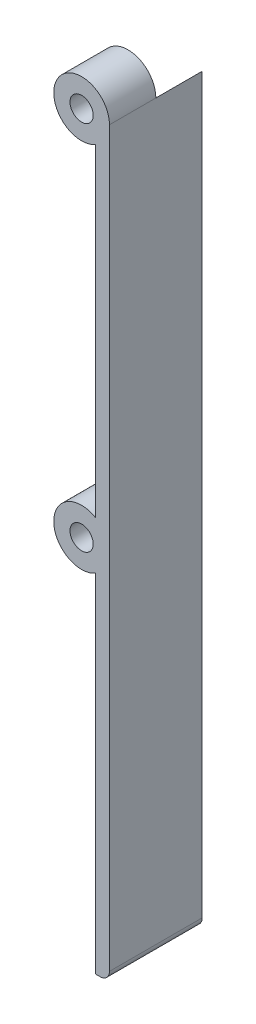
ISO-10303-21;
HEADER;
FILE_DESCRIPTION(('STEP AP214'),'2;1');
FILE_NAME('part.step','',(''),(''),'','','');
FILE_SCHEMA(('AUTOMOTIVE_DESIGN { 1 0 10303 214 1 1 1 1 }'));
ENDSEC;
DATA;
#1=APPLICATION_CONTEXT('core data for automotive mechanical design processes');
#2=APPLICATION_PROTOCOL_DEFINITION('international standard','automotive_design',2000,#1);
#3=PRODUCT_CONTEXT('',#1,'mechanical');
#4=PRODUCT('Part','Part','',(#3));
#5=PRODUCT_RELATED_PRODUCT_CATEGORY('part','',(#4));
#6=PRODUCT_DEFINITION_FORMATION('','',#4);
#7=PRODUCT_DEFINITION_CONTEXT('part definition',#1,'design');
#8=PRODUCT_DEFINITION('design','',#6,#7);
#9=PRODUCT_DEFINITION_SHAPE('','',#8);
#10=(LENGTH_UNIT() NAMED_UNIT(*) SI_UNIT(.MILLI.,.METRE.));
#11=(NAMED_UNIT(*) PLANE_ANGLE_UNIT() SI_UNIT($,.RADIAN.));
#12=(NAMED_UNIT(*) SI_UNIT($,.STERADIAN.) SOLID_ANGLE_UNIT());
#13=UNCERTAINTY_MEASURE_WITH_UNIT(LENGTH_MEASURE(1.E-05),#10,'distance_accuracy_value','');
#14=(GEOMETRIC_REPRESENTATION_CONTEXT(3) GLOBAL_UNCERTAINTY_ASSIGNED_CONTEXT((#13)) GLOBAL_UNIT_ASSIGNED_CONTEXT((#10,
#11,#12)) REPRESENTATION_CONTEXT('',''));
#15=CARTESIAN_POINT('',(0.,0.,0.));
#16=DIRECTION('',(0.,0.,1.));
#17=DIRECTION('',(1.,0.,0.));
#18=AXIS2_PLACEMENT_3D('',#15,#16,#17);
#19=CARTESIAN_POINT('',(0.,80.,20.));
#20=DIRECTION('',(0.,0.,-1.));
#21=DIRECTION('',(-1.,0.,0.));
#22=AXIS2_PLACEMENT_3D('',#19,#20,#21);
#23=CYLINDRICAL_SURFACE('',#22,6.);
#24=CARTESIAN_POINT('',(0.,80.,10.));
#25=DIRECTION('',(0.,0.,-1.));
#26=DIRECTION('',(-1.,0.,0.));
#27=AXIS2_PLACEMENT_3D('',#24,#25,#26);
#28=CIRCLE('',#27,6.);
#29=CARTESIAN_POINT('',(2.99999999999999,74.8038475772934,10.));
#30=VERTEX_POINT('',#29);
#31=CARTESIAN_POINT('',(5.99999999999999,80.,10.));
#32=VERTEX_POINT('',#31);
#33=EDGE_CURVE('E125',#30,#32,#28,.T.);
#34=ORIENTED_EDGE('',*,*,#33,.F.);
#35=DIRECTION('',(0.,0.,-1.));
#36=VECTOR('',#35,1.);
#37=CARTESIAN_POINT('',(2.99999999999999,74.8038475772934,20.));
#38=LINE('',#37,#36);
#39=CARTESIAN_POINT('',(2.99999999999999,74.8038475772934,20.));
#40=VERTEX_POINT('',#39);
#41=EDGE_CURVE('E165',#40,#30,#38,.T.);
#42=ORIENTED_EDGE('',*,*,#41,.F.);
#43=CARTESIAN_POINT('',(0.,80.,20.));
#44=DIRECTION('',(0.,0.,1.));
#45=DIRECTION('',(1.,0.,0.));
#46=AXIS2_PLACEMENT_3D('',#43,#44,#45);
#47=CIRCLE('',#46,6.);
#48=CARTESIAN_POINT('',(5.99999999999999,80.,20.));
#49=VERTEX_POINT('',#48);
#50=EDGE_CURVE('E142',#49,#40,#47,.T.);
#51=ORIENTED_EDGE('',*,*,#50,.F.);
#52=DIRECTION('',(0.,0.,-1.));
#53=VECTOR('',#52,1.);
#54=CARTESIAN_POINT('',(5.99999999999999,80.,20.));
#55=LINE('',#54,#53);
#56=EDGE_CURVE('E168',#49,#32,#55,.T.);
#57=ORIENTED_EDGE('',*,*,#56,.T.);
#58=EDGE_LOOP('',(#34,#42,#51,#57));
#59=FACE_BOUND('',#58,.T.);
#60=ADVANCED_FACE('F33',(#59),#23,.T.);
#61=CARTESIAN_POINT('',(0.,80.,20.));
#62=DIRECTION('',(0.,0.,-1.));
#63=DIRECTION('',(-1.,0.,0.));
#64=AXIS2_PLACEMENT_3D('',#61,#62,#63);
#65=CYLINDRICAL_SURFACE('',#64,2.5);
#66=CARTESIAN_POINT('',(0.,80.,20.));
#67=DIRECTION('',(0.,0.,1.));
#68=DIRECTION('',(1.,0.,0.));
#69=AXIS2_PLACEMENT_3D('',#66,#67,#68);
#70=CIRCLE('',#69,2.5);
#71=CARTESIAN_POINT('',(2.5,80.,20.));
#72=VERTEX_POINT('',#71);
#73=EDGE_CURVE('E118',#72,#72,#70,.T.);
#74=ORIENTED_EDGE('',*,*,#73,.T.);
#75=EDGE_LOOP('',(#74));
#76=FACE_BOUND('',#75,.T.);
#77=CARTESIAN_POINT('',(0.,80.,10.));
#78=DIRECTION('',(0.,0.,-1.));
#79=DIRECTION('',(-1.,0.,0.));
#80=AXIS2_PLACEMENT_3D('',#77,#78,#79);
#81=CIRCLE('',#80,2.5);
#82=CARTESIAN_POINT('',(-2.50000000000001,80.,10.));
#83=VERTEX_POINT('',#82);
#84=EDGE_CURVE('E119',#83,#83,#81,.T.);
#85=ORIENTED_EDGE('',*,*,#84,.T.);
#86=EDGE_LOOP('',(#85));
#87=FACE_BOUND('',#86,.T.);
#88=ADVANCED_FACE('F199',(#76,#87),#65,.F.);
#89=CARTESIAN_POINT('',(0.,80.,20.));
#90=DIRECTION('',(0.,0.,1.));
#91=DIRECTION('',(1.,0.,0.));
#92=AXIS2_PLACEMENT_3D('',#89,#90,#91);
#93=PLANE('',#92);
#94=CARTESIAN_POINT('',(0.,0.,20.));
#95=DIRECTION('',(0.,0.,1.));
#96=DIRECTION('',(1.,0.,0.));
#97=AXIS2_PLACEMENT_3D('',#94,#95,#96);
#98=CIRCLE('',#97,2.5);
#99=CARTESIAN_POINT('',(2.5,0.,20.));
#100=VERTEX_POINT('',#99);
#101=EDGE_CURVE('E132',#100,#100,#98,.T.);
#102=ORIENTED_EDGE('',*,*,#101,.F.);
#103=EDGE_LOOP('',(#102));
#104=FACE_BOUND('',#103,.T.);
#105=DIRECTION('',(1.,0.,0.));
#106=VECTOR('',#105,1.);
#107=CARTESIAN_POINT('',(3.00000000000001,-80.,20.));
#108=LINE('',#107,#106);
#109=CARTESIAN_POINT('',(3.00000000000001,-80.,20.));
#110=VERTEX_POINT('',#109);
#111=CARTESIAN_POINT('',(4.00000000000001,-80.,20.));
#112=VERTEX_POINT('',#111);
#113=EDGE_CURVE('E137',#110,#112,#108,.T.);
#114=ORIENTED_EDGE('',*,*,#113,.T.);
#115=CARTESIAN_POINT('',(4.00000000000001,-78.,20.));
#116=DIRECTION('',(0.,0.,1.));
#117=DIRECTION('',(1.,0.,0.));
#118=AXIS2_PLACEMENT_3D('',#115,#116,#117);
#119=CIRCLE('',#118,2.);
#120=CARTESIAN_POINT('',(6.00000000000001,-78.,20.));
#121=VERTEX_POINT('',#120);
#122=EDGE_CURVE('E11',#112,#121,#119,.T.);
#123=ORIENTED_EDGE('',*,*,#122,.T.);
#124=DIRECTION('',(0.,1.,0.));
#125=VECTOR('',#124,1.);
#126=CARTESIAN_POINT('',(5.99999999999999,80.,20.));
#127=LINE('',#126,#125);
#128=EDGE_CURVE('E139',#121,#49,#127,.T.);
#129=ORIENTED_EDGE('',*,*,#128,.T.);
#130=ORIENTED_EDGE('',*,*,#50,.T.);
#131=DIRECTION('',(0.,-1.,0.));
#132=VECTOR('',#131,1.);
#133=CARTESIAN_POINT('',(2.99999999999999,74.8038475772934,20.));
#134=LINE('',#133,#132);
#135=CARTESIAN_POINT('',(3.,5.19615242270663,20.));
#136=VERTEX_POINT('',#135);
#137=EDGE_CURVE('E144',#40,#136,#134,.T.);
#138=ORIENTED_EDGE('',*,*,#137,.T.);
#139=CARTESIAN_POINT('',(0.,0.,20.));
#140=DIRECTION('',(0.,0.,1.));
#141=DIRECTION('',(1.,0.,0.));
#142=AXIS2_PLACEMENT_3D('',#139,#140,#141);
#143=CIRCLE('',#142,6.);
#144=CARTESIAN_POINT('',(3.,-5.19615242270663,20.));
#145=VERTEX_POINT('',#144);
#146=EDGE_CURVE('E146',#136,#145,#143,.T.);
#147=ORIENTED_EDGE('',*,*,#146,.T.);
#148=DIRECTION('',(0.,-1.,0.));
#149=VECTOR('',#148,1.);
#150=CARTESIAN_POINT('',(3.,-5.19615242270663,20.));
#151=LINE('',#150,#149);
#152=EDGE_CURVE('E148',#145,#110,#151,.T.);
#153=ORIENTED_EDGE('',*,*,#152,.T.);
#154=EDGE_LOOP('',(#114,#123,#129,#130,#138,#147,#153));
#155=FACE_BOUND('',#154,.T.);
#156=ORIENTED_EDGE('',*,*,#73,.F.);
#157=EDGE_LOOP('',(#156));
#158=FACE_BOUND('',#157,.T.);
#159=ADVANCED_FACE('F187',(#104,#155,#158),#93,.T.);
#160=CARTESIAN_POINT('',(0.,80.,0.));
#161=DIRECTION('',(0.,0.,1.));
#162=DIRECTION('',(1.,0.,0.));
#163=AXIS2_PLACEMENT_3D('',#160,#161,#162);
#164=PLANE('',#163);
#165=DIRECTION('',(0.,1.,0.));
#166=VECTOR('',#165,1.);
#167=CARTESIAN_POINT('',(5.99999999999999,80.,0.));
#168=LINE('',#167,#166);
#169=CARTESIAN_POINT('',(6.00000000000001,-78.,0.));
#170=VERTEX_POINT('',#169);
#171=CARTESIAN_POINT('',(5.99999999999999,80.,0.));
#172=VERTEX_POINT('',#171);
#173=EDGE_CURVE('E98',#170,#172,#168,.T.);
#174=ORIENTED_EDGE('',*,*,#173,.F.);
#175=CARTESIAN_POINT('',(4.00000000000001,-78.,0.));
#176=DIRECTION('',(0.,0.,1.));
#177=DIRECTION('',(1.,0.,0.));
#178=AXIS2_PLACEMENT_3D('',#175,#176,#177);
#179=CIRCLE('',#178,2.);
#180=CARTESIAN_POINT('',(4.00000000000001,-80.,0.));
#181=VERTEX_POINT('',#180);
#182=EDGE_CURVE('E55',#170,#181,#179,.F.);
#183=ORIENTED_EDGE('',*,*,#182,.T.);
#184=DIRECTION('',(1.,0.,0.));
#185=VECTOR('',#184,1.);
#186=CARTESIAN_POINT('',(3.00000000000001,-80.,0.));
#187=LINE('',#186,#185);
#188=CARTESIAN_POINT('',(3.00000000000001,-80.,0.));
#189=VERTEX_POINT('',#188);
#190=EDGE_CURVE('E109',#189,#181,#187,.T.);
#191=ORIENTED_EDGE('',*,*,#190,.F.);
#192=DIRECTION('',(0.,-1.,0.));
#193=VECTOR('',#192,1.);
#194=CARTESIAN_POINT('',(3.,-5.19615242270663,0.));
#195=LINE('',#194,#193);
#196=CARTESIAN_POINT('',(3.,-5.19615242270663,0.));
#197=VERTEX_POINT('',#196);
#198=EDGE_CURVE('E140',#197,#189,#195,.T.);
#199=ORIENTED_EDGE('',*,*,#198,.F.);
#200=CARTESIAN_POINT('',(0.,0.,0.));
#201=DIRECTION('',(0.,0.,1.));
#202=DIRECTION('',(1.,0.,0.));
#203=AXIS2_PLACEMENT_3D('',#200,#201,#202);
#204=CIRCLE('',#203,6.);
#205=CARTESIAN_POINT('',(3.,5.19615242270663,0.));
#206=VERTEX_POINT('',#205);
#207=EDGE_CURVE('E153',#206,#197,#204,.T.);
#208=ORIENTED_EDGE('',*,*,#207,.F.);
#209=DIRECTION('',(0.,-1.,0.));
#210=VECTOR('',#209,1.);
#211=CARTESIAN_POINT('',(2.99999999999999,74.8038475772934,0.));
#212=LINE('',#211,#210);
#213=CARTESIAN_POINT('',(2.99999999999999,74.8038475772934,0.));
#214=VERTEX_POINT('',#213);
#215=EDGE_CURVE('E108',#214,#206,#212,.T.);
#216=ORIENTED_EDGE('',*,*,#215,.F.);
#217=CARTESIAN_POINT('',(0.,80.,0.));
#218=DIRECTION('',(0.,0.,-1.));
#219=DIRECTION('',(-1.,0.,0.));
#220=AXIS2_PLACEMENT_3D('',#217,#218,#219);
#221=CIRCLE('',#220,6.);
#222=EDGE_CURVE('E114',#172,#214,#221,.T.);
#223=ORIENTED_EDGE('',*,*,#222,.F.);
#224=EDGE_LOOP('',(#174,#183,#191,#199,#208,#216,#223));
#225=FACE_BOUND('',#224,.T.);
#226=CARTESIAN_POINT('',(0.,0.,0.));
#227=DIRECTION('',(0.,0.,1.));
#228=DIRECTION('',(1.,0.,0.));
#229=AXIS2_PLACEMENT_3D('',#226,#227,#228);
#230=CIRCLE('',#229,2.5);
#231=CARTESIAN_POINT('',(2.5,0.,0.));
#232=VERTEX_POINT('',#231);
#233=EDGE_CURVE('E131',#232,#232,#230,.T.);
#234=ORIENTED_EDGE('',*,*,#233,.T.);
#235=EDGE_LOOP('',(#234));
#236=FACE_BOUND('',#235,.T.);
#237=ADVANCED_FACE('F122',(#225,#236),#164,.F.);
#238=CARTESIAN_POINT('',(3.00000000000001,-80.,20.));
#239=DIRECTION('',(0.,1.,0.));
#240=DIRECTION('',(0.,0.,1.));
#241=AXIS2_PLACEMENT_3D('',#238,#239,#240);
#242=PLANE('',#241);
#243=ORIENTED_EDGE('',*,*,#190,.T.);
#244=DIRECTION('',(0.,0.,-1.));
#245=VECTOR('',#244,1.);
#246=CARTESIAN_POINT('',(4.00000000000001,-80.,20.));
#247=LINE('',#246,#245);
#248=EDGE_CURVE('E41',#181,#112,#247,.F.);
#249=ORIENTED_EDGE('',*,*,#248,.T.);
#250=ORIENTED_EDGE('',*,*,#113,.F.);
#251=DIRECTION('',(0.,0.,-1.));
#252=VECTOR('',#251,1.);
#253=CARTESIAN_POINT('',(3.00000000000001,-80.,20.));
#254=LINE('',#253,#252);
#255=EDGE_CURVE('E150',#110,#189,#254,.T.);
#256=ORIENTED_EDGE('',*,*,#255,.T.);
#257=EDGE_LOOP('',(#243,#249,#250,#256));
#258=FACE_BOUND('',#257,.T.);
#259=ADVANCED_FACE('F210',(#258),#242,.F.);
#260=CARTESIAN_POINT('',(5.99999999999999,80.,20.));
#261=DIRECTION('',(-1.,0.,0.));
#262=DIRECTION('',(0.,-1.,0.));
#263=AXIS2_PLACEMENT_3D('',#260,#261,#262);
#264=PLANE('',#263);
#265=ORIENTED_EDGE('',*,*,#128,.F.);
#266=DIRECTION('',(0.,0.,-1.));
#267=VECTOR('',#266,1.);
#268=CARTESIAN_POINT('',(6.00000000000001,-78.,20.));
#269=LINE('',#268,#267);
#270=EDGE_CURVE('E106',#121,#170,#269,.T.);
#271=ORIENTED_EDGE('',*,*,#270,.T.);
#272=ORIENTED_EDGE('',*,*,#173,.T.);
#273=DIRECTION('',(0.,0.,-1.));
#274=VECTOR('',#273,1.);
#275=CARTESIAN_POINT('',(5.99999999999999,80.,10.));
#276=LINE('',#275,#274);
#277=EDGE_CURVE('E103',#32,#172,#276,.T.);
#278=ORIENTED_EDGE('',*,*,#277,.F.);
#279=ORIENTED_EDGE('',*,*,#56,.F.);
#280=EDGE_LOOP('',(#265,#271,#272,#278,#279));
#281=FACE_BOUND('',#280,.T.);
#282=ADVANCED_FACE('F101',(#281),#264,.F.);
#283=CARTESIAN_POINT('',(2.99999999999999,74.8038475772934,20.));
#284=DIRECTION('',(1.,0.,0.));
#285=DIRECTION('',(0.,1.,0.));
#286=AXIS2_PLACEMENT_3D('',#283,#284,#285);
#287=PLANE('',#286);
#288=ORIENTED_EDGE('',*,*,#215,.T.);
#289=DIRECTION('',(0.,0.,-1.));
#290=VECTOR('',#289,1.);
#291=CARTESIAN_POINT('',(3.,5.19615242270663,20.));
#292=LINE('',#291,#290);
#293=EDGE_CURVE('E161',#136,#206,#292,.T.);
#294=ORIENTED_EDGE('',*,*,#293,.F.);
#295=ORIENTED_EDGE('',*,*,#137,.F.);
#296=ORIENTED_EDGE('',*,*,#41,.T.);
#297=EDGE_CURVE('E164',#30,#214,#38,.T.);
#298=ORIENTED_EDGE('',*,*,#297,.T.);
#299=EDGE_LOOP('',(#288,#294,#295,#296,#298));
#300=FACE_BOUND('',#299,.T.);
#301=ADVANCED_FACE('F183',(#300),#287,.F.);
#302=CARTESIAN_POINT('',(0.,0.,20.));
#303=DIRECTION('',(0.,0.,-1.));
#304=DIRECTION('',(-1.,0.,0.));
#305=AXIS2_PLACEMENT_3D('',#302,#303,#304);
#306=CYLINDRICAL_SURFACE('',#305,6.);
#307=ORIENTED_EDGE('',*,*,#207,.T.);
#308=DIRECTION('',(0.,0.,-1.));
#309=VECTOR('',#308,1.);
#310=CARTESIAN_POINT('',(3.,-5.19615242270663,20.));
#311=LINE('',#310,#309);
#312=EDGE_CURVE('E158',#145,#197,#311,.T.);
#313=ORIENTED_EDGE('',*,*,#312,.F.);
#314=ORIENTED_EDGE('',*,*,#146,.F.);
#315=ORIENTED_EDGE('',*,*,#293,.T.);
#316=EDGE_LOOP('',(#307,#313,#314,#315));
#317=FACE_BOUND('',#316,.T.);
#318=ADVANCED_FACE('F222',(#317),#306,.T.);
#319=CARTESIAN_POINT('',(3.,-5.19615242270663,20.));
#320=DIRECTION('',(1.,0.,0.));
#321=DIRECTION('',(0.,1.,0.));
#322=AXIS2_PLACEMENT_3D('',#319,#320,#321);
#323=PLANE('',#322);
#324=ORIENTED_EDGE('',*,*,#198,.T.);
#325=ORIENTED_EDGE('',*,*,#255,.F.);
#326=ORIENTED_EDGE('',*,*,#152,.F.);
#327=ORIENTED_EDGE('',*,*,#312,.T.);
#328=EDGE_LOOP('',(#324,#325,#326,#327));
#329=FACE_BOUND('',#328,.T.);
#330=ADVANCED_FACE('F219',(#329),#323,.F.);
#331=CARTESIAN_POINT('',(0.,0.,20.));
#332=DIRECTION('',(0.,0.,-1.));
#333=DIRECTION('',(-1.,0.,0.));
#334=AXIS2_PLACEMENT_3D('',#331,#332,#333);
#335=CYLINDRICAL_SURFACE('',#334,2.5);
#336=ORIENTED_EDGE('',*,*,#101,.T.);
#337=EDGE_LOOP('',(#336));
#338=FACE_BOUND('',#337,.T.);
#339=ORIENTED_EDGE('',*,*,#233,.F.);
#340=EDGE_LOOP('',(#339));
#341=FACE_BOUND('',#340,.T.);
#342=ADVANCED_FACE('F228',(#338,#341),#335,.F.);
#343=CARTESIAN_POINT('',(0.,80.,10.));
#344=DIRECTION('',(0.,0.,-1.));
#345=DIRECTION('',(-1.,0.,0.));
#346=AXIS2_PLACEMENT_3D('',#343,#344,#345);
#347=CYLINDRICAL_SURFACE('',#346,6.);
#348=ORIENTED_EDGE('',*,*,#277,.T.);
#349=ORIENTED_EDGE('',*,*,#222,.T.);
#350=ORIENTED_EDGE('',*,*,#297,.F.);
#351=EDGE_CURVE('E117',#32,#30,#28,.T.);
#352=ORIENTED_EDGE('',*,*,#351,.F.);
#353=EDGE_LOOP('',(#348,#349,#350,#352));
#354=FACE_BOUND('',#353,.T.);
#355=ADVANCED_FACE('F113',(#354),#347,.F.);
#356=CARTESIAN_POINT('',(0.,80.,10.));
#357=DIRECTION('',(0.,0.,-1.));
#358=DIRECTION('',(-1.,0.,0.));
#359=AXIS2_PLACEMENT_3D('',#356,#357,#358);
#360=PLANE('',#359);
#361=ORIENTED_EDGE('',*,*,#84,.F.);
#362=EDGE_LOOP('',(#361));
#363=FACE_BOUND('',#362,.T.);
#364=ORIENTED_EDGE('',*,*,#351,.T.);
#365=ORIENTED_EDGE('',*,*,#33,.T.);
#366=EDGE_LOOP('',(#364,#365));
#367=FACE_BOUND('',#366,.T.);
#368=ADVANCED_FACE('F177',(#363,#367),#360,.T.);
#369=CARTESIAN_POINT('',(4.00000000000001,-78.,20.));
#370=DIRECTION('',(0.,0.,-1.));
#371=DIRECTION('',(-1.,0.,0.));
#372=AXIS2_PLACEMENT_3D('',#369,#370,#371);
#373=CYLINDRICAL_SURFACE('',#372,2.);
#374=ORIENTED_EDGE('',*,*,#122,.F.);
#375=ORIENTED_EDGE('',*,*,#248,.F.);
#376=ORIENTED_EDGE('',*,*,#182,.F.);
#377=ORIENTED_EDGE('',*,*,#270,.F.);
#378=EDGE_LOOP('',(#374,#375,#376,#377));
#379=FACE_BOUND('',#378,.T.);
#380=ADVANCED_FACE('F35',(#379),#373,.T.);
#381=CLOSED_SHELL('',(#60,#88,#159,#237,#259,#282,#301,#318,#330,#342,#355,#368,#380));
#382=MANIFOLD_SOLID_BREP('B2',#381);
#383=ADVANCED_BREP_SHAPE_REPRESENTATION('',(#18,#382),#14);
#384=SHAPE_DEFINITION_REPRESENTATION(#9,#383);
ENDSEC;
END-ISO-10303-21;
